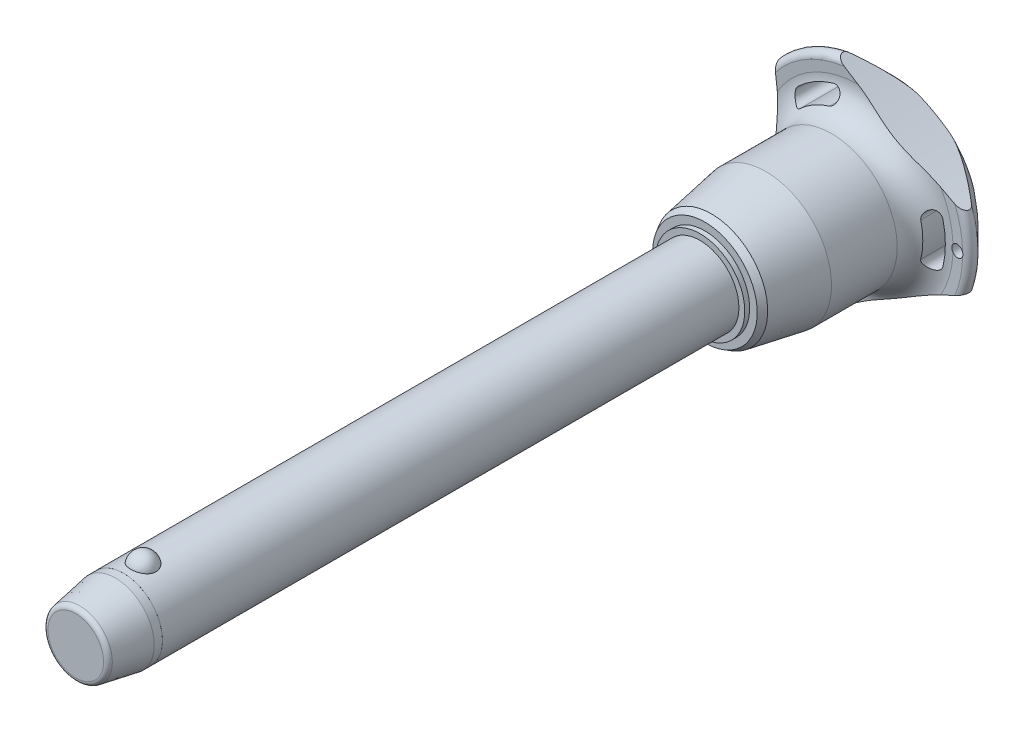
from build123d import *

# Parameters (mm, degrees)
SKETCH1_R           = 10
BOSS_EXTRUDE1_DEPTH = 140
SKETCH2_R           = 8.75
BOSS_EXTRUDE2_DEPTH = 50.7
BOSS_EXTRUDE3_START = 20.5
SKETCH1_2_R         = 10
BOSS_EXTRUDE3_DEPTH = 20.5
CHAMFER1_SIZE       = 10.25
CHAMFER1_SIZE2      = 1.807351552
FILLET1_R           = 1.25
SKETCH6_R           = 176.92625
CUT_EXTRUDE1_DEPTH  = 195.927884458
CIRPATTERN1_COUNT   = 3
SKETCH7_R           = 1.5
CUT_EXTRUDE2_DEPTH  = 195.849774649
SKETCH8_R           = 10
SKETCH8_R_2         = 9.99
CUT_EXTRUDE3_DEPTH  = 12.3


with BuildPart() as part:
    # Sketch1 → Boss-Extrude1 (new body)
    with BuildSketch(Plane.XY):
        Circle(SKETCH1_R)
    extrude(amount=-BOSS_EXTRUDE1_DEPTH)

    # Sketch2 → Boss-Extrude2 (add)
    with BuildSketch(Plane(origin=(0, 0, -140), x_dir=(-1, 0, 0), z_dir=(0, 0, -1))):
        with Locations(Location((0, 0, 0), (0, 0, 180))):
            Circle(SKETCH2_R)
    extrude(amount=BOSS_EXTRUDE2_DEPTH)

    # Sketch3 → Revolve1 (revolve)
    with BuildSketch(Plane(origin=(0, 0, 0), x_dir=(0, 0, -1), z_dir=(1, 0, 0))):
        with BuildLine():
            Line((-3.201562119, 12.5), (-3.201562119, 5.9))
            ThreePointArc((-3.201562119, 5.9), (0.098437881, 9.2), (-3.201562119, 12.5))
        make_face()
        with BuildLine():
            Line((-3.201562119, -5.9), (-3.201562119, -12.5))
            ThreePointArc((-3.201562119, -12.5), (0.098437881, -9.2), (-3.201562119, -5.9))
        make_face()
    revolve(axis=Axis((0, -5.9, 3.201562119), (0, 1, 0)))

    # Sketch1_2 → Boss-Extrude3 (add)
    with BuildSketch(Plane.XY.offset(BOSS_EXTRUDE3_START)):
        Circle(SKETCH1_2_R)
    extrude(amount=-BOSS_EXTRUDE3_DEPTH)

    # Chamfer1
    chamfer1_edges = [part.edges().sort_by_distance(p)[0] for p in [
        (-10, 0, 20.5),
    ]]
    chamfer1_side = [part.faces().sort_by_distance(p)[0] for p in [
        (-10, 0, -59.75),
    ]]
    chamfer(chamfer1_edges, length=CHAMFER1_SIZE, length2=CHAMFER1_SIZE2, reference=chamfer1_side[0])

    # Fillet1
    fillet1_edges = [part.edges().sort_by_distance(p)[0] for p in [
        (-8.192648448, 0, 20.5),
        (-8.75, 0, -190.7),
    ]]
    fillet(fillet1_edges, radius=FILLET1_R)

    # Sketch4 → Revolve2 (revolve)
    with BuildSketch(Plane(origin=(0, 0, 0), x_dir=(0, 0, -1), z_dir=(1, 0, 0)), mode=Mode.PRIVATE) as revolve2_sk:
        Polygon((140, 0), (140, 11.504815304), (141.25, 11.504815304), (141.25, 13.461079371), (142.944174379, 14.439211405), (156.9, 16.9), (173.8, 16.9), (173.8, 0), align=None)
    revolve(revolve2_sk.sketch.rotate(Axis((0, 0, -173.8), (0, 0, 1)), 90), axis=Axis((0, 0, -173.8), (0, 0, 1)))

    # Sketch5 → Revolve3 (revolve)
    with BuildSketch(Plane(origin=(0, 0, 0), x_dir=(0, 0, -1), z_dir=(1, 0, 0)), mode=Mode.PRIVATE) as revolve3_sk:
        with BuildLine():
            Line((180.790129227, 24.271609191), (180.652256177, 26.865060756))
            ThreePointArc((180.652256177, 26.865060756), (181.598671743, 28.411427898), (183.38137085, 28.08137085))
            Line((183.38137085, 28.08137085), (189.763226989, 21.69951471))
            ThreePointArc((189.763226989, 21.69951471), (190.7, 19.381044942), (189.683055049, 17.096604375))
            ThreePointArc((189.683055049, 17.096604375), (184.18864484, 9.321268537), (182.25, 0))
            Line((182.25, 0), (173.8, 0))
            Line((173.8, 0), (173.8, 16.9))
            ThreePointArc((173.8, 16.9), (178.879432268, 19.083427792), (180.790129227, 24.271609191))
        make_face()
    revolve(revolve3_sk.sketch.rotate(Axis((0, 0, -182.25), (0, 0, 1)), 90), axis=Axis((0, 0, -182.25), (0, 0, 1)))

    # Sketch6 → Cut-Extrude1 (cut, through all)
    with BuildSketch(Plane.XY):
        with Locations((-197.42625, 0)):
            Circle(SKETCH6_R)
        with BuildLine():
            ThreePointArc((21.802992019, -5.260839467), (22.428706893, 0), (21.802992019, 5.260839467))
            ThreePointArc((21.802992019, 5.260839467), (19.579234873, 6.620060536), (18.220013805, 4.39630339))
            ThreePointArc((18.220013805, 4.39630339), (18.742902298, 0), (18.220013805, -4.39630339))
            ThreePointArc((18.220013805, -4.39630339), (19.579234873, -6.620060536), (21.802992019, -5.260839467))
        make_face()
    cut_extrude1 = extrude(amount=-CUT_EXTRUDE1_DEPTH, mode=Mode.SUBTRACT)

    # CirPattern1: Cut-Extrude1 ×3 about axis
    cirpattern1_axis = Axis((0, 0, 0), (0, 0, 1))
    for i in range(1, CIRPATTERN1_COUNT):
        add(cut_extrude1.rotate(cirpattern1_axis, i * 360 / CIRPATTERN1_COUNT), mode=Mode.SUBTRACT)

    # Sketch7 → Cut-Extrude2 (cut, through all)
    with BuildSketch(Plane.XY):
        with Locations(Location((25.428706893, 0, 0), (0, 0, 17.230769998))):
            Circle(SKETCH7_R)
    extrude(amount=-CUT_EXTRUDE2_DEPTH, mode=Mode.SUBTRACT)

    # Sketch8 → Cut-Extrude3 (cut)
    with BuildSketch(Plane.XY.offset(20.5)):
        Circle(SKETCH8_R)
        Circle(SKETCH8_R_2, mode=Mode.SUBTRACT)
    extrude(amount=-CUT_EXTRUDE3_DEPTH, mode=Mode.SUBTRACT)


solid = part.part
